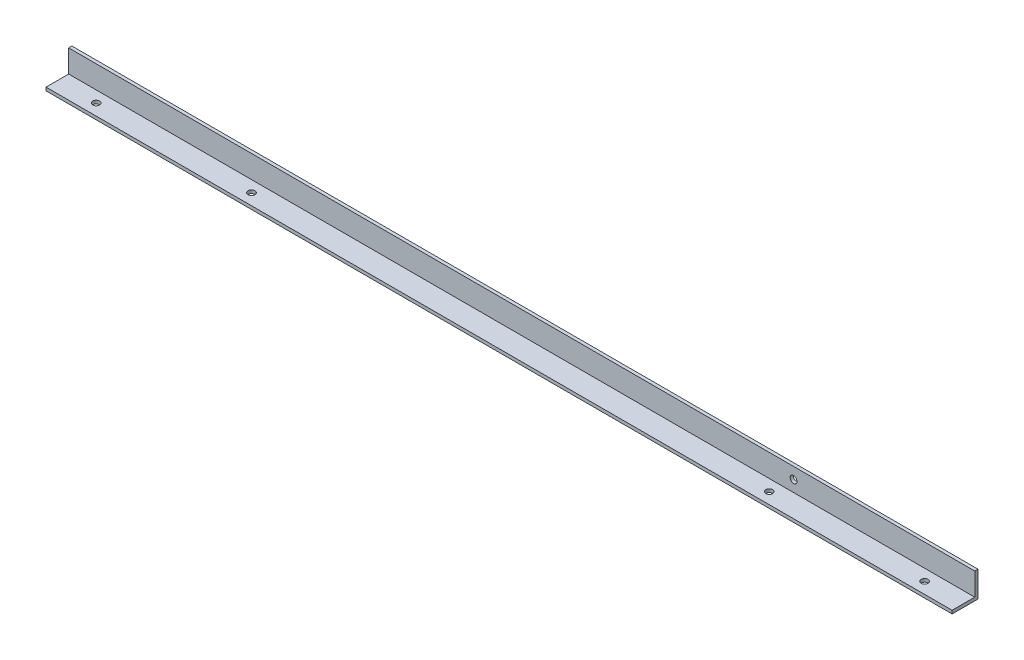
from build123d import *

# Parameters (mm, degrees)
SKETCH1_W           = 889
SKETCH1_H           = 25.4
BOSS_EXTRUDE1_DEPTH = 3.175
SKETCH2_W           = 889
SKETCH2_H           = 3.175
BOSS_EXTRUDE2_DEPTH = 22.225
SKETCH3_R           = 3.3782
CUT_EXTRUDE1_DEPTH  = 446.236443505
SKETCH4_R           = 3.3782
CUT_EXTRUDE2_DEPTH  = 446.779497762


with BuildPart() as part:
    # Sketch1 → Boss-Extrude1 (new body)
    with BuildSketch(Plane(origin=(0, 0, 0), x_dir=(1, 0, 0), z_dir=(0, 1, 0))):
        Rectangle(SKETCH1_W, SKETCH1_H)
    extrude(amount=BOSS_EXTRUDE1_DEPTH)

    # Sketch2 → Boss-Extrude2 (add)
    with BuildSketch(Plane(origin=(0, 3.175, 0), x_dir=(1, 0, 0), z_dir=(0, 1, 0))):
        with Locations((0, 11.1125)):
            Rectangle(SKETCH2_W, SKETCH2_H)
    extrude(amount=BOSS_EXTRUDE2_DEPTH)

    # Sketch3 → Cut-Extrude1 (cut, through all)
    with BuildSketch(Plane(origin=(0, 3.175, 0), x_dir=(1, 0, 0), z_dir=(0, 1, 0))):
        with Locations(Location((-406.4, -1.5875, 0), (0, 0, 270))):
            Circle(SKETCH3_R)
        with Locations(Location((-254, -1.5875, 0), (0, 0, 270))):
            Circle(SKETCH3_R)
        with Locations(Location((406.4, -1.5875, 0), (0, 0, 270))):
            Circle(SKETCH3_R)
        with Locations(Location((254, -1.5875, 0), (0, 0, 270))):
            Circle(SKETCH3_R)
    extrude(amount=-CUT_EXTRUDE1_DEPTH, mode=Mode.SUBTRACT)

    # Sketch4 → Cut-Extrude2 (cut, through all)
    with BuildSketch(Plane.XY.offset(-9.525)):
        with Locations((266.7, 14.2875)):
            Circle(SKETCH4_R)
    extrude(amount=-CUT_EXTRUDE2_DEPTH, mode=Mode.SUBTRACT)


solid = part.part
